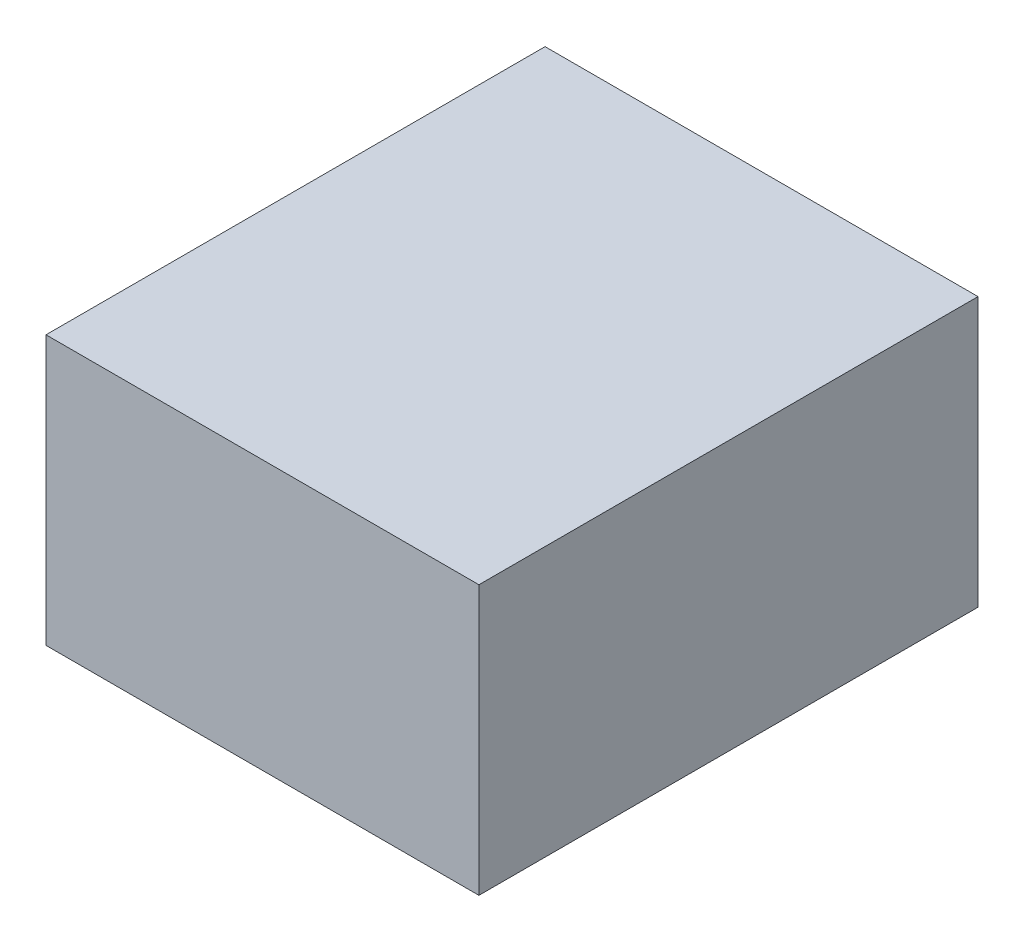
ISO-10303-21;
HEADER;
FILE_DESCRIPTION(('STEP AP214'),'2;1');
FILE_NAME('part.step','',(''),(''),'','','');
FILE_SCHEMA(('AUTOMOTIVE_DESIGN { 1 0 10303 214 1 1 1 1 }'));
ENDSEC;
DATA;
#1=APPLICATION_CONTEXT('core data for automotive mechanical design processes');
#2=APPLICATION_PROTOCOL_DEFINITION('international standard','automotive_design',2000,#1);
#3=PRODUCT_CONTEXT('',#1,'mechanical');
#4=PRODUCT('Part','Part','',(#3));
#5=PRODUCT_RELATED_PRODUCT_CATEGORY('part','',(#4));
#6=PRODUCT_DEFINITION_FORMATION('','',#4);
#7=PRODUCT_DEFINITION_CONTEXT('part definition',#1,'design');
#8=PRODUCT_DEFINITION('design','',#6,#7);
#9=PRODUCT_DEFINITION_SHAPE('','',#8);
#10=(LENGTH_UNIT() NAMED_UNIT(*) SI_UNIT(.MILLI.,.METRE.));
#11=(NAMED_UNIT(*) PLANE_ANGLE_UNIT() SI_UNIT($,.RADIAN.));
#12=(NAMED_UNIT(*) SI_UNIT($,.STERADIAN.) SOLID_ANGLE_UNIT());
#13=UNCERTAINTY_MEASURE_WITH_UNIT(LENGTH_MEASURE(1.E-05),#10,'distance_accuracy_value','');
#14=(GEOMETRIC_REPRESENTATION_CONTEXT(3) GLOBAL_UNCERTAINTY_ASSIGNED_CONTEXT((#13)) GLOBAL_UNIT_ASSIGNED_CONTEXT((#10,
#11,#12)) REPRESENTATION_CONTEXT('',''));
#15=CARTESIAN_POINT('',(0.,0.,0.));
#16=DIRECTION('',(0.,0.,1.));
#17=DIRECTION('',(1.,0.,0.));
#18=AXIS2_PLACEMENT_3D('',#15,#16,#17);
#19=CARTESIAN_POINT('',(-63.7578979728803,-39.6183470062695,73.5));
#20=DIRECTION('',(1.,0.,0.));
#21=DIRECTION('',(0.,0.,-1.));
#22=AXIS2_PLACEMENT_3D('',#19,#20,#21);
#23=PLANE('',#22);
#24=DIRECTION('',(0.,-1.,0.));
#25=VECTOR('',#24,1.);
#26=CARTESIAN_POINT('',(-63.7578979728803,-39.6183470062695,-73.5));
#27=LINE('',#26,#25);
#28=CARTESIAN_POINT('',(-63.7578979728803,39.6183470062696,-73.5));
#29=VERTEX_POINT('',#28);
#30=CARTESIAN_POINT('',(-63.7578979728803,-39.6183470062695,-73.5));
#31=VERTEX_POINT('',#30);
#32=EDGE_CURVE('E94',#29,#31,#27,.T.);
#33=ORIENTED_EDGE('',*,*,#32,.T.);
#34=DIRECTION('',(0.,0.,-1.));
#35=VECTOR('',#34,1.);
#36=CARTESIAN_POINT('',(-63.7578979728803,-39.6183470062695,73.5));
#37=LINE('',#36,#35);
#38=CARTESIAN_POINT('',(-63.7578979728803,-39.6183470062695,73.5));
#39=VERTEX_POINT('',#38);
#40=EDGE_CURVE('E11',#39,#31,#37,.T.);
#41=ORIENTED_EDGE('',*,*,#40,.F.);
#42=DIRECTION('',(0.,-1.,0.));
#43=VECTOR('',#42,1.);
#44=CARTESIAN_POINT('',(-63.7578979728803,-39.6183470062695,73.5));
#45=LINE('',#44,#43);
#46=CARTESIAN_POINT('',(-63.7578979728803,39.6183470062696,73.5));
#47=VERTEX_POINT('',#46);
#48=EDGE_CURVE('E82',#47,#39,#45,.T.);
#49=ORIENTED_EDGE('',*,*,#48,.F.);
#50=DIRECTION('',(0.,0.,-1.));
#51=VECTOR('',#50,1.);
#52=CARTESIAN_POINT('',(-63.7578979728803,39.6183470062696,73.5));
#53=LINE('',#52,#51);
#54=EDGE_CURVE('E90',#47,#29,#53,.T.);
#55=ORIENTED_EDGE('',*,*,#54,.T.);
#56=EDGE_LOOP('',(#33,#41,#49,#55));
#57=FACE_BOUND('',#56,.T.);
#58=ADVANCED_FACE('F31',(#57),#23,.F.);
#59=CARTESIAN_POINT('',(-63.7578979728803,-39.6183470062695,73.5));
#60=DIRECTION('',(0.,1.,0.));
#61=DIRECTION('',(0.,0.,1.));
#62=AXIS2_PLACEMENT_3D('',#59,#60,#61);
#63=PLANE('',#62);
#64=DIRECTION('',(1.,0.,0.));
#65=VECTOR('',#64,1.);
#66=CARTESIAN_POINT('',(-63.7578979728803,-39.6183470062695,-73.5));
#67=LINE('',#66,#65);
#68=CARTESIAN_POINT('',(63.7578979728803,-39.6183470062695,-73.5));
#69=VERTEX_POINT('',#68);
#70=EDGE_CURVE('E86',#31,#69,#67,.T.);
#71=ORIENTED_EDGE('',*,*,#70,.T.);
#72=DIRECTION('',(0.,0.,-1.));
#73=VECTOR('',#72,1.);
#74=CARTESIAN_POINT('',(63.7578979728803,-39.6183470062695,73.5));
#75=LINE('',#74,#73);
#76=CARTESIAN_POINT('',(63.7578979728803,-39.6183470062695,73.5));
#77=VERTEX_POINT('',#76);
#78=EDGE_CURVE('E39',#77,#69,#75,.T.);
#79=ORIENTED_EDGE('',*,*,#78,.F.);
#80=DIRECTION('',(1.,0.,0.));
#81=VECTOR('',#80,1.);
#82=CARTESIAN_POINT('',(-63.7578979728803,-39.6183470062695,73.5));
#83=LINE('',#82,#81);
#84=EDGE_CURVE('E77',#39,#77,#83,.T.);
#85=ORIENTED_EDGE('',*,*,#84,.F.);
#86=ORIENTED_EDGE('',*,*,#40,.T.);
#87=EDGE_LOOP('',(#71,#79,#85,#86));
#88=FACE_BOUND('',#87,.T.);
#89=ADVANCED_FACE('F85',(#88),#63,.F.);
#90=CARTESIAN_POINT('',(63.7578979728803,-39.6183470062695,73.5));
#91=DIRECTION('',(-1.,0.,0.));
#92=DIRECTION('',(0.,0.,1.));
#93=AXIS2_PLACEMENT_3D('',#90,#91,#92);
#94=PLANE('',#93);
#95=DIRECTION('',(0.,1.,0.));
#96=VECTOR('',#95,1.);
#97=CARTESIAN_POINT('',(63.7578979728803,-39.6183470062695,-73.5));
#98=LINE('',#97,#96);
#99=CARTESIAN_POINT('',(63.7578979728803,39.6183470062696,-73.5));
#100=VERTEX_POINT('',#99);
#101=EDGE_CURVE('E64',#69,#100,#98,.T.);
#102=ORIENTED_EDGE('',*,*,#101,.T.);
#103=DIRECTION('',(0.,0.,-1.));
#104=VECTOR('',#103,1.);
#105=CARTESIAN_POINT('',(63.7578979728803,39.6183470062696,73.5));
#106=LINE('',#105,#104);
#107=CARTESIAN_POINT('',(63.7578979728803,39.6183470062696,73.5));
#108=VERTEX_POINT('',#107);
#109=EDGE_CURVE('E87',#108,#100,#106,.T.);
#110=ORIENTED_EDGE('',*,*,#109,.F.);
#111=DIRECTION('',(0.,1.,0.));
#112=VECTOR('',#111,1.);
#113=CARTESIAN_POINT('',(63.7578979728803,-39.6183470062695,73.5));
#114=LINE('',#113,#112);
#115=EDGE_CURVE('E80',#77,#108,#114,.T.);
#116=ORIENTED_EDGE('',*,*,#115,.F.);
#117=ORIENTED_EDGE('',*,*,#78,.T.);
#118=EDGE_LOOP('',(#102,#110,#116,#117));
#119=FACE_BOUND('',#118,.T.);
#120=ADVANCED_FACE('F88',(#119),#94,.F.);
#121=CARTESIAN_POINT('',(-63.7578979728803,39.6183470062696,73.5));
#122=DIRECTION('',(0.,-1.,0.));
#123=DIRECTION('',(0.,0.,-1.));
#124=AXIS2_PLACEMENT_3D('',#121,#122,#123);
#125=PLANE('',#124);
#126=DIRECTION('',(-1.,0.,0.));
#127=VECTOR('',#126,1.);
#128=CARTESIAN_POINT('',(-63.7578979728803,39.6183470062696,-73.5));
#129=LINE('',#128,#127);
#130=EDGE_CURVE('E70',#100,#29,#129,.T.);
#131=ORIENTED_EDGE('',*,*,#130,.T.);
#132=ORIENTED_EDGE('',*,*,#54,.F.);
#133=DIRECTION('',(-1.,0.,0.));
#134=VECTOR('',#133,1.);
#135=CARTESIAN_POINT('',(-63.7578979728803,39.6183470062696,73.5));
#136=LINE('',#135,#134);
#137=EDGE_CURVE('E47',#108,#47,#136,.T.);
#138=ORIENTED_EDGE('',*,*,#137,.F.);
#139=ORIENTED_EDGE('',*,*,#109,.T.);
#140=EDGE_LOOP('',(#131,#132,#138,#139));
#141=FACE_BOUND('',#140,.T.);
#142=ADVANCED_FACE('F101',(#141),#125,.F.);
#143=CARTESIAN_POINT('',(-63.7578979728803,39.6183470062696,73.5));
#144=DIRECTION('',(0.,0.,-1.));
#145=DIRECTION('',(-1.,0.,0.));
#146=AXIS2_PLACEMENT_3D('',#143,#144,#145);
#147=PLANE('',#146);
#148=ORIENTED_EDGE('',*,*,#48,.T.);
#149=ORIENTED_EDGE('',*,*,#84,.T.);
#150=ORIENTED_EDGE('',*,*,#115,.T.);
#151=ORIENTED_EDGE('',*,*,#137,.T.);
#152=EDGE_LOOP('',(#148,#149,#150,#151));
#153=FACE_BOUND('',#152,.T.);
#154=ADVANCED_FACE('F78',(#153),#147,.F.);
#155=CARTESIAN_POINT('',(-63.7578979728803,39.6183470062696,-73.5));
#156=DIRECTION('',(0.,0.,-1.));
#157=DIRECTION('',(-1.,0.,0.));
#158=AXIS2_PLACEMENT_3D('',#155,#156,#157);
#159=PLANE('',#158);
#160=ORIENTED_EDGE('',*,*,#32,.F.);
#161=ORIENTED_EDGE('',*,*,#130,.F.);
#162=ORIENTED_EDGE('',*,*,#101,.F.);
#163=ORIENTED_EDGE('',*,*,#70,.F.);
#164=EDGE_LOOP('',(#160,#161,#162,#163));
#165=FACE_BOUND('',#164,.T.);
#166=ADVANCED_FACE('F104',(#165),#159,.T.);
#167=CLOSED_SHELL('',(#58,#89,#120,#142,#154,#166));
#168=MANIFOLD_SOLID_BREP('B2',#167);
#169=ADVANCED_BREP_SHAPE_REPRESENTATION('',(#18,#168),#14);
#170=SHAPE_DEFINITION_REPRESENTATION(#9,#169);
ENDSEC;
END-ISO-10303-21;
